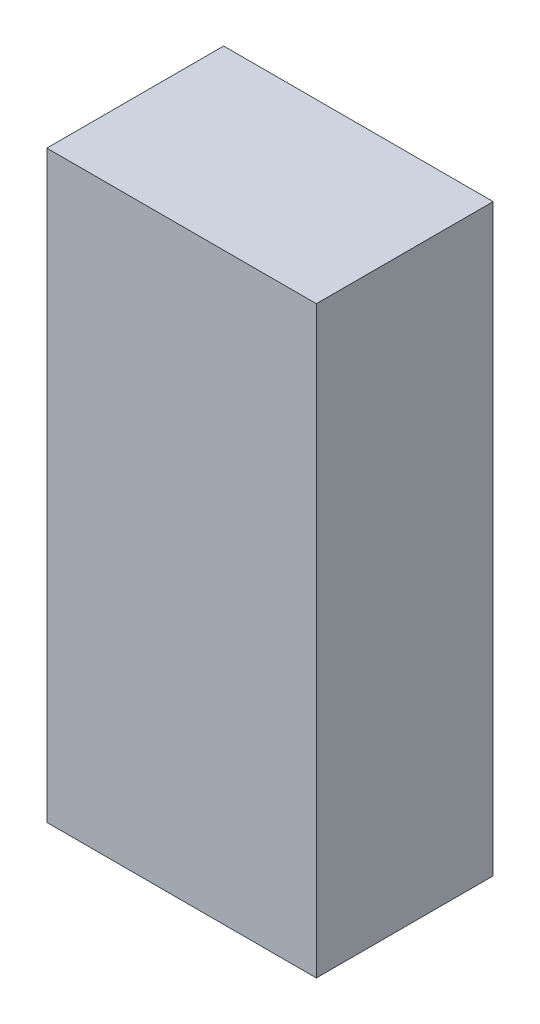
ISO-10303-21;
HEADER;
FILE_DESCRIPTION(('STEP AP214'),'2;1');
FILE_NAME('part.step','',(''),(''),'','','');
FILE_SCHEMA(('AUTOMOTIVE_DESIGN { 1 0 10303 214 1 1 1 1 }'));
ENDSEC;
DATA;
#1=APPLICATION_CONTEXT('core data for automotive mechanical design processes');
#2=APPLICATION_PROTOCOL_DEFINITION('international standard','automotive_design',2000,#1);
#3=PRODUCT_CONTEXT('',#1,'mechanical');
#4=PRODUCT('Part','Part','',(#3));
#5=PRODUCT_RELATED_PRODUCT_CATEGORY('part','',(#4));
#6=PRODUCT_DEFINITION_FORMATION('','',#4);
#7=PRODUCT_DEFINITION_CONTEXT('part definition',#1,'design');
#8=PRODUCT_DEFINITION('design','',#6,#7);
#9=PRODUCT_DEFINITION_SHAPE('','',#8);
#10=(LENGTH_UNIT() NAMED_UNIT(*) SI_UNIT(.MILLI.,.METRE.));
#11=(NAMED_UNIT(*) PLANE_ANGLE_UNIT() SI_UNIT($,.RADIAN.));
#12=(NAMED_UNIT(*) SI_UNIT($,.STERADIAN.) SOLID_ANGLE_UNIT());
#13=UNCERTAINTY_MEASURE_WITH_UNIT(LENGTH_MEASURE(1.E-05),#10,'distance_accuracy_value','');
#14=(GEOMETRIC_REPRESENTATION_CONTEXT(3) GLOBAL_UNCERTAINTY_ASSIGNED_CONTEXT((#13)) GLOBAL_UNIT_ASSIGNED_CONTEXT((#10,
#11,#12)) REPRESENTATION_CONTEXT('',''));
#15=CARTESIAN_POINT('',(0.,0.,0.));
#16=DIRECTION('',(0.,0.,1.));
#17=DIRECTION('',(1.,0.,0.));
#18=AXIS2_PLACEMENT_3D('',#15,#16,#17);
#19=CARTESIAN_POINT('',(0.,0.,1.00000054));
#20=DIRECTION('',(0.,0.,1.));
#21=DIRECTION('',(1.,0.,0.));
#22=AXIS2_PLACEMENT_3D('',#19,#20,#21);
#23=PLANE('',#22);
#24=DIRECTION('',(0.,1.,0.));
#25=VECTOR('',#24,1.);
#26=CARTESIAN_POINT('',(0.76204064,-1.651,1.00000054));
#27=LINE('',#26,#25);
#28=CARTESIAN_POINT('',(0.76204064,-1.651,1.00000054));
#29=VERTEX_POINT('',#28);
#30=CARTESIAN_POINT('',(0.76204064,1.651,1.00000054));
#31=VERTEX_POINT('',#30);
#32=EDGE_CURVE('E82',#29,#31,#27,.T.);
#33=ORIENTED_EDGE('',*,*,#32,.T.);
#34=DIRECTION('',(-1.,0.,0.));
#35=VECTOR('',#34,1.);
#36=CARTESIAN_POINT('',(0.76204064,1.651,1.00000054));
#37=LINE('',#36,#35);
#38=CARTESIAN_POINT('',(-0.76204064,1.651,1.00000054));
#39=VERTEX_POINT('',#38);
#40=EDGE_CURVE('E98',#31,#39,#37,.T.);
#41=ORIENTED_EDGE('',*,*,#40,.T.);
#42=DIRECTION('',(0.,-1.,0.));
#43=VECTOR('',#42,1.);
#44=CARTESIAN_POINT('',(-0.76204064,1.651,1.00000054));
#45=LINE('',#44,#43);
#46=CARTESIAN_POINT('',(-0.76204064,-1.651,1.00000054));
#47=VERTEX_POINT('',#46);
#48=EDGE_CURVE('E75',#39,#47,#45,.T.);
#49=ORIENTED_EDGE('',*,*,#48,.T.);
#50=DIRECTION('',(1.,0.,0.));
#51=VECTOR('',#50,1.);
#52=CARTESIAN_POINT('',(-0.76204064,-1.651,1.00000054));
#53=LINE('',#52,#51);
#54=EDGE_CURVE('E11',#47,#29,#53,.T.);
#55=ORIENTED_EDGE('',*,*,#54,.T.);
#56=EDGE_LOOP('',(#33,#41,#49,#55));
#57=FACE_BOUND('',#56,.T.);
#58=ADVANCED_FACE('F17',(#57),#23,.T.);
#59=CARTESIAN_POINT('',(0.,0.,0.));
#60=DIRECTION('',(0.,0.,1.));
#61=DIRECTION('',(1.,0.,0.));
#62=AXIS2_PLACEMENT_3D('',#59,#60,#61);
#63=PLANE('',#62);
#64=DIRECTION('',(1.,0.,0.));
#65=VECTOR('',#64,1.);
#66=CARTESIAN_POINT('',(-0.76204064,-1.651,0.));
#67=LINE('',#66,#65);
#68=CARTESIAN_POINT('',(-0.76204064,-1.651,0.));
#69=VERTEX_POINT('',#68);
#70=CARTESIAN_POINT('',(0.76204064,-1.651,0.));
#71=VERTEX_POINT('',#70);
#72=EDGE_CURVE('E20',#69,#71,#67,.T.);
#73=ORIENTED_EDGE('',*,*,#72,.F.);
#74=DIRECTION('',(0.,-1.,0.));
#75=VECTOR('',#74,1.);
#76=CARTESIAN_POINT('',(-0.76204064,1.651,0.));
#77=LINE('',#76,#75);
#78=CARTESIAN_POINT('',(-0.76204064,1.651,0.));
#79=VERTEX_POINT('',#78);
#80=EDGE_CURVE('E108',#79,#69,#77,.T.);
#81=ORIENTED_EDGE('',*,*,#80,.F.);
#82=DIRECTION('',(-1.,0.,0.));
#83=VECTOR('',#82,1.);
#84=CARTESIAN_POINT('',(0.76204064,1.651,0.));
#85=LINE('',#84,#83);
#86=CARTESIAN_POINT('',(0.76204064,1.651,0.));
#87=VERTEX_POINT('',#86);
#88=EDGE_CURVE('E84',#87,#79,#85,.T.);
#89=ORIENTED_EDGE('',*,*,#88,.F.);
#90=DIRECTION('',(0.,1.,0.));
#91=VECTOR('',#90,1.);
#92=CARTESIAN_POINT('',(0.76204064,-1.651,0.));
#93=LINE('',#92,#91);
#94=EDGE_CURVE('E80',#71,#87,#93,.T.);
#95=ORIENTED_EDGE('',*,*,#94,.F.);
#96=EDGE_LOOP('',(#73,#81,#89,#95));
#97=FACE_BOUND('',#96,.T.);
#98=ADVANCED_FACE('F86',(#97),#63,.F.);
#99=CARTESIAN_POINT('',(-0.76204064,-1.651,0.));
#100=DIRECTION('',(0.,1.,0.));
#101=DIRECTION('',(1.,0.,0.));
#102=AXIS2_PLACEMENT_3D('',#99,#100,#101);
#103=PLANE('',#102);
#104=ORIENTED_EDGE('',*,*,#72,.T.);
#105=DIRECTION('',(0.,0.,1.));
#106=VECTOR('',#105,1.);
#107=CARTESIAN_POINT('',(0.76204064,-1.651,0.));
#108=LINE('',#107,#106);
#109=EDGE_CURVE('E69',#71,#29,#108,.T.);
#110=ORIENTED_EDGE('',*,*,#109,.T.);
#111=ORIENTED_EDGE('',*,*,#54,.F.);
#112=DIRECTION('',(0.,0.,1.));
#113=VECTOR('',#112,1.);
#114=CARTESIAN_POINT('',(-0.76204064,-1.651,0.));
#115=LINE('',#114,#113);
#116=EDGE_CURVE('E72',#69,#47,#115,.T.);
#117=ORIENTED_EDGE('',*,*,#116,.F.);
#118=EDGE_LOOP('',(#104,#110,#111,#117));
#119=FACE_BOUND('',#118,.T.);
#120=ADVANCED_FACE('F68',(#119),#103,.F.);
#121=CARTESIAN_POINT('',(-0.76204064,1.651,0.));
#122=DIRECTION('',(1.,0.,0.));
#123=DIRECTION('',(0.,1.,0.));
#124=AXIS2_PLACEMENT_3D('',#121,#122,#123);
#125=PLANE('',#124);
#126=ORIENTED_EDGE('',*,*,#80,.T.);
#127=ORIENTED_EDGE('',*,*,#116,.T.);
#128=ORIENTED_EDGE('',*,*,#48,.F.);
#129=DIRECTION('',(0.,0.,1.));
#130=VECTOR('',#129,1.);
#131=CARTESIAN_POINT('',(-0.76204064,1.651,0.));
#132=LINE('',#131,#130);
#133=EDGE_CURVE('E104',#79,#39,#132,.T.);
#134=ORIENTED_EDGE('',*,*,#133,.F.);
#135=EDGE_LOOP('',(#126,#127,#128,#134));
#136=FACE_BOUND('',#135,.T.);
#137=ADVANCED_FACE('F119',(#136),#125,.F.);
#138=CARTESIAN_POINT('',(0.76204064,1.651,0.));
#139=DIRECTION('',(0.,-1.,0.));
#140=DIRECTION('',(0.,0.,-1.));
#141=AXIS2_PLACEMENT_3D('',#138,#139,#140);
#142=PLANE('',#141);
#143=ORIENTED_EDGE('',*,*,#88,.T.);
#144=ORIENTED_EDGE('',*,*,#133,.T.);
#145=ORIENTED_EDGE('',*,*,#40,.F.);
#146=DIRECTION('',(0.,0.,1.));
#147=VECTOR('',#146,1.);
#148=CARTESIAN_POINT('',(0.76204064,1.651,0.));
#149=LINE('',#148,#147);
#150=EDGE_CURVE('E90',#87,#31,#149,.T.);
#151=ORIENTED_EDGE('',*,*,#150,.F.);
#152=EDGE_LOOP('',(#143,#144,#145,#151));
#153=FACE_BOUND('',#152,.T.);
#154=ADVANCED_FACE('F121',(#153),#142,.F.);
#155=CARTESIAN_POINT('',(0.76204064,-1.651,0.));
#156=DIRECTION('',(-1.,0.,0.));
#157=DIRECTION('',(0.,0.,1.));
#158=AXIS2_PLACEMENT_3D('',#155,#156,#157);
#159=PLANE('',#158);
#160=ORIENTED_EDGE('',*,*,#94,.T.);
#161=ORIENTED_EDGE('',*,*,#150,.T.);
#162=ORIENTED_EDGE('',*,*,#32,.F.);
#163=ORIENTED_EDGE('',*,*,#109,.F.);
#164=EDGE_LOOP('',(#160,#161,#162,#163));
#165=FACE_BOUND('',#164,.T.);
#166=ADVANCED_FACE('F78',(#165),#159,.F.);
#167=CLOSED_SHELL('',(#58,#98,#120,#137,#154,#166));
#168=MANIFOLD_SOLID_BREP('B1',#167);
#169=ADVANCED_BREP_SHAPE_REPRESENTATION('',(#18,#168),#14);
#170=SHAPE_DEFINITION_REPRESENTATION(#9,#169);
ENDSEC;
END-ISO-10303-21;
